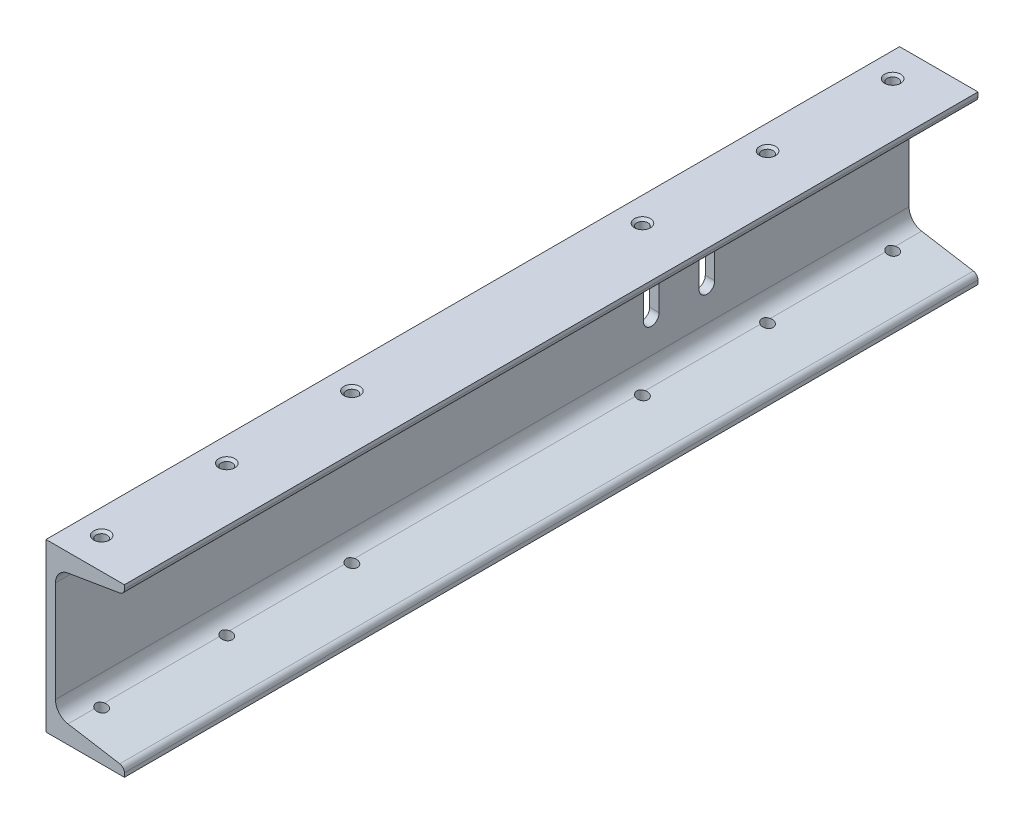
from build123d import *

# Parameters (mm, degrees)
BOSS_EXTRUDE1_DEPTH              = 389.899906
F_1_4_20_TAPPED_HOLE5_AT_2_COUNT = 2
F_1_4_20_TAPPED_HOLE5_AT_2_PITCH = 114.3
F_1_4_20_TAPPED_HOLE5_AT_3_COUNT = 2
F_1_4_20_TAPPED_HOLE5_AT_3_PITCH = 57.15
F_1_4_20_TAPPED_HOLE5_AT_4_COUNT = 2
F_1_4_20_TAPPED_HOLE5_AT_4_PITCH = 247.024906
F_1_4_20_TAPPED_HOLE5_AT_5_COUNT = 2
F_1_4_20_TAPPED_HOLE5_AT_5_PITCH = 189.874906
F_1_4_20_TAPPED_HOLE5_AT_6_COUNT = 2
F_1_4_20_TAPPED_HOLE5_AT_6_PITCH = 132.724906
CUT_EXTRUDE2_DEPTH               = 399.887226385


with BuildPart() as part:
    # Sketch1 → Boss-Extrude1 (new body)
    with BuildSketch(Plane.XY):
        with BuildLine():
            Line((0, 0), (0, 76.2))
            Line((0, 76.2), (35.814, 76.2))
            Line((35.814, 76.2), (35.814, 74.387435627))
            ThreePointArc((35.814, 74.387435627), (35.212080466, 72.745654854), (33.691603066, 71.882))
            Line((33.691603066, 71.882), (10.048471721, 67.941190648))
            ThreePointArc((10.048471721, 67.941190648), (5.943182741, 65.609322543), (4.318, 61.176514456))
            Line((4.318, 61.176514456), (4.318, 15.023485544))
            ThreePointArc((4.318, 15.023485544), (5.943182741, 10.590677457), (10.048471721, 8.258809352))
            Line((10.048471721, 8.258809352), (33.691603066, 4.318))
            ThreePointArc((33.691603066, 4.318), (35.212080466, 3.454345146), (35.814, 1.812564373))
            Line((35.814, 1.812564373), (35.814, 0))
            Line((35.814, 0), (0, 0))
        make_face()
    extrude(amount=BOSS_EXTRUDE1_DEPTH)

    # Sketch9 → 1_4-20 Tapped Hole5 (revolve, cut)
    with BuildSketch(Plane(origin=(11.1252, 76.2, 261.312406), x_dir=(0, 0, 1), z_dir=(1, 0, 0))):
        Polygon((0, 0), (0, 62.710331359), (2.5527, 61.176514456), (2.5527, 1.1049), (3.6576, 0), align=None)
    f_1_4_20_tapped_hole5 = revolve(axis=Axis((11.1252, 82.55, 261.312406), (0, -1, 0)), mode=Mode.SUBTRACT)

    # 1_4-20 Tapped Hole5 at 2: 1_4-20 Tapped Hole5 ×2
    with Locations(*[(0, 0, i * F_1_4_20_TAPPED_HOLE5_AT_2_PITCH) for i in range(1, F_1_4_20_TAPPED_HOLE5_AT_2_COUNT)]):
        add(f_1_4_20_tapped_hole5, mode=Mode.SUBTRACT)

    # 1_4-20 Tapped Hole5 at 3: 1_4-20 Tapped Hole5 ×2
    with Locations(*[(0, 0, i * F_1_4_20_TAPPED_HOLE5_AT_3_PITCH) for i in range(1, F_1_4_20_TAPPED_HOLE5_AT_3_COUNT)]):
        add(f_1_4_20_tapped_hole5, mode=Mode.SUBTRACT)

    # 1_4-20 Tapped Hole5 at 4: 1_4-20 Tapped Hole5 ×2
    with Locations(*[(0, 0, -i * F_1_4_20_TAPPED_HOLE5_AT_4_PITCH) for i in range(1, F_1_4_20_TAPPED_HOLE5_AT_4_COUNT)]):
        add(f_1_4_20_tapped_hole5, mode=Mode.SUBTRACT)

    # 1_4-20 Tapped Hole5 at 5: 1_4-20 Tapped Hole5 ×2
    with Locations(*[(0, 0, -i * F_1_4_20_TAPPED_HOLE5_AT_5_PITCH) for i in range(1, F_1_4_20_TAPPED_HOLE5_AT_5_COUNT)]):
        add(f_1_4_20_tapped_hole5, mode=Mode.SUBTRACT)

    # 1_4-20 Tapped Hole5 at 6: 1_4-20 Tapped Hole5 ×2
    with Locations(*[(0, 0, -i * F_1_4_20_TAPPED_HOLE5_AT_6_PITCH) for i in range(1, F_1_4_20_TAPPED_HOLE5_AT_6_COUNT)]):
        add(f_1_4_20_tapped_hole5, mode=Mode.SUBTRACT)

    # Sketch10 → Cut-Extrude2 (cut, through all)
    with BuildSketch(Plane.ZY):
        with BuildLine():
            Line((88.7603, 30.1625), (88.7603, 46.0375))
            ThreePointArc((88.7603, 46.0375), (92.329, 49.6062), (95.8977, 46.0375))
            Line((95.8977, 46.0375), (95.8977, 30.1625))
            ThreePointArc((95.8977, 30.1625), (92.329, 26.5938), (88.7603, 30.1625))
        make_face()
        with BuildLine():
            Line((114.1603, 30.1625), (114.1603, 46.0375))
            ThreePointArc((114.1603, 46.0375), (117.729, 49.6062), (121.2977, 46.0375))
            Line((121.2977, 46.0375), (121.2977, 30.1625))
            ThreePointArc((121.2977, 30.1625), (117.729, 26.5938), (114.1603, 30.1625))
        make_face()
    extrude(amount=-CUT_EXTRUDE2_DEPTH, mode=Mode.SUBTRACT)

    # Mirror1: 1_4-20 Tapped Hole5 across plane
    add(f_1_4_20_tapped_hole5.mirror(Plane(origin=(0, 38.1, 0), x_dir=(0, 0, 1), z_dir=(0, -1, 0))), mode=Mode.SUBTRACT)

    # Mirror1 copy 1 sketch → Mirror1 copy 1 (revolve, cut)
    with BuildSketch(Plane(origin=(11.1252, 0, 375.612406), x_dir=(0, 0, 1), z_dir=(1, 0, 0))):
        Polygon((0, 0), (0, -62.710331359), (2.5527, -61.176514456), (2.5527, -1.1049), (3.6576, 0), align=None)
    revolve(axis=Axis((11.1252, -6.35, 375.612406), (0, -1, 0)), mode=Mode.SUBTRACT)

    # Mirror1 copy 2 sketch → Mirror1 copy 2 (revolve, cut)
    with BuildSketch(Plane(origin=(11.1252, 0, 318.462406), x_dir=(0, 0, 1), z_dir=(1, 0, 0))):
        Polygon((0, 0), (0, -62.710331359), (2.5527, -61.176514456), (2.5527, -1.1049), (3.6576, 0), align=None)
    revolve(axis=Axis((11.1252, -6.35, 318.462406), (0, -1, 0)), mode=Mode.SUBTRACT)

    # Mirror1 copy 3 sketch → Mirror1 copy 3 (revolve, cut)
    with BuildSketch(Plane(origin=(11.1252, 0, 14.2875), x_dir=(0, 0, 1), z_dir=(1, 0, 0))):
        Polygon((0, 0), (0, -62.710331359), (2.5527, -61.176514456), (2.5527, -1.1049), (3.6576, 0), align=None)
    revolve(axis=Axis((11.1252, -6.35, 14.2875), (0, -1, 0)), mode=Mode.SUBTRACT)

    # Mirror1 copy 4 sketch → Mirror1 copy 4 (revolve, cut)
    with BuildSketch(Plane(origin=(11.1252, 0, 71.4375), x_dir=(0, 0, 1), z_dir=(1, 0, 0))):
        Polygon((0, 0), (0, -62.710331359), (2.5527, -61.176514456), (2.5527, -1.1049), (3.6576, 0), align=None)
    revolve(axis=Axis((11.1252, -6.35, 71.4375), (0, -1, 0)), mode=Mode.SUBTRACT)

    # Mirror1 copy 5 sketch → Mirror1 copy 5 (revolve, cut)
    with BuildSketch(Plane(origin=(11.1252, 0, 128.5875), x_dir=(0, 0, 1), z_dir=(1, 0, 0))):
        Polygon((0, 0), (0, -62.710331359), (2.5527, -61.176514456), (2.5527, -1.1049), (3.6576, 0), align=None)
    revolve(axis=Axis((11.1252, -6.35, 128.5875), (0, -1, 0)), mode=Mode.SUBTRACT)


solid = part.part
